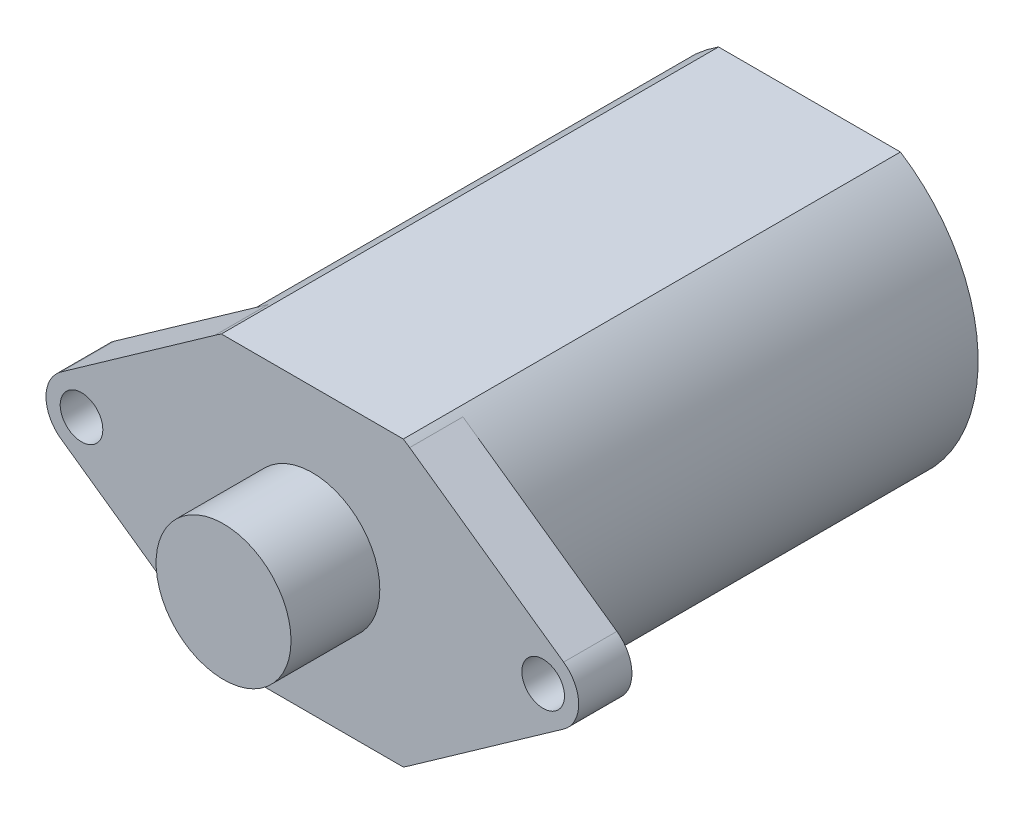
from build123d import *

# Parameters (mm, degrees)
SKETCH_1_R          = 47.5
EXTRUDE_1_DEPTH     = 140
EXTRUDE_START       = -15
EXTRUDE_2_DEPTH     = 15
CUT_EXTRUDE_1_DEPTH = 140
SKETCH_4_R          = 6
CUT_EXTRUDE_2_DEPTH = 164.783393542
SKETCH_5_R          = 19
EXTRUDE_3_DEPTH     = 25


with BuildPart() as part:
    # Sketch 1 → Extrude 1 (new body)
    with BuildSketch(Plane.XY):
        Circle(SKETCH_1_R)
    extrude(amount=EXTRUDE_1_DEPTH)

    # Sketch 2 → Extrude 2 (add)
    with BuildSketch(Plane.XY.offset(140).offset(EXTRUDE_START)):
        with BuildLine():
            Line((-70.769230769, 8.167984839), (-27.403846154, 38.797927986))
            ThreePointArc((-27.403846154, 38.797927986), (-47.5, 0), (-27.403846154, -38.797927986))
            Line((-27.403846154, -38.797927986), (-70.769230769, -8.167984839))
            ThreePointArc((-70.769230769, -8.167984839), (-75, 0), (-70.769230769, 8.167984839))
        make_face()
        with BuildLine():
            Line((70.769230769, 8.167984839), (27.403846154, 38.797927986))
            ThreePointArc((27.403846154, 38.797927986), (47.5, 0), (27.403846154, -38.797927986))
            Line((27.403846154, -38.797927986), (70.769230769, -8.167984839))
            ThreePointArc((70.769230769, -8.167984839), (75, 0), (70.769230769, 8.167984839))
        make_face()
    extrude(amount=EXTRUDE_2_DEPTH)

    # Sketch 3 → Cut-Extrude 1 (cut)
    with BuildSketch(Plane(origin=(0, 0, 0), x_dir=(-1, 0, 0), z_dir=(0, 0, -1))):
        with BuildLine():
            Line((-25.617376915, 40), (25.617376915, 40))
            ThreePointArc((25.617376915, 40), (0, 47.5), (-25.617376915, 40))
        make_face()
        with BuildLine():
            Line((-25.617376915, -40), (25.617376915, -40))
            ThreePointArc((25.617376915, -40), (0, -47.5), (-25.617376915, -40))
        make_face()
    extrude(amount=-CUT_EXTRUDE_1_DEPTH, mode=Mode.SUBTRACT)

    # Sketch 4 → Cut-Extrude 2 (cut, through all)
    with BuildSketch(Plane.XY.offset(140)):
        with Locations((-65, 0)):
            Circle(SKETCH_4_R)
        with Locations((65, 0)):
            Circle(SKETCH_4_R)
    extrude(amount=-CUT_EXTRUDE_2_DEPTH, mode=Mode.SUBTRACT)

    # Sketch 5 → Extrude 3 (add)
    with BuildSketch(Plane.XY.offset(140)):
        Circle(SKETCH_5_R)
    extrude(amount=EXTRUDE_3_DEPTH)


solid = part.part
